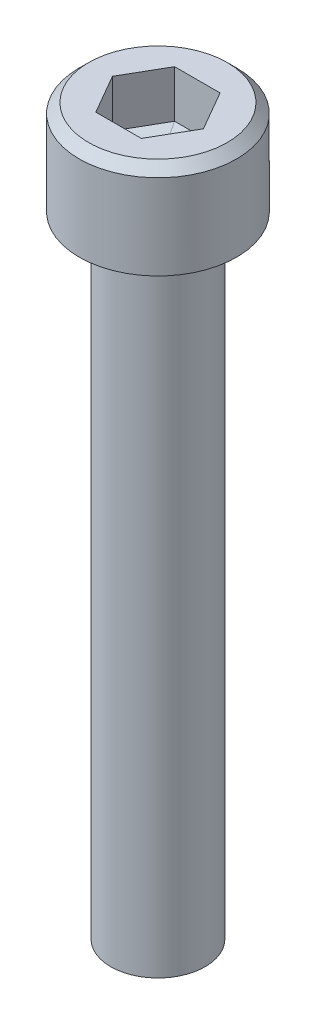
ISO-10303-21;
HEADER;
FILE_DESCRIPTION(('STEP AP214'),'2;1');
FILE_NAME('part.step','',(''),(''),'','','');
FILE_SCHEMA(('AUTOMOTIVE_DESIGN { 1 0 10303 214 1 1 1 1 }'));
ENDSEC;
DATA;
#1=APPLICATION_CONTEXT('core data for automotive mechanical design processes');
#2=APPLICATION_PROTOCOL_DEFINITION('international standard','automotive_design',2000,#1);
#3=PRODUCT_CONTEXT('',#1,'mechanical');
#4=PRODUCT('Part','Part','',(#3));
#5=PRODUCT_RELATED_PRODUCT_CATEGORY('part','',(#4));
#6=PRODUCT_DEFINITION_FORMATION('','',#4);
#7=PRODUCT_DEFINITION_CONTEXT('part definition',#1,'design');
#8=PRODUCT_DEFINITION('design','',#6,#7);
#9=PRODUCT_DEFINITION_SHAPE('','',#8);
#10=(LENGTH_UNIT() NAMED_UNIT(*) SI_UNIT(.MILLI.,.METRE.));
#11=(NAMED_UNIT(*) PLANE_ANGLE_UNIT() SI_UNIT($,.RADIAN.));
#12=(NAMED_UNIT(*) SI_UNIT($,.STERADIAN.) SOLID_ANGLE_UNIT());
#13=UNCERTAINTY_MEASURE_WITH_UNIT(LENGTH_MEASURE(1.E-05),#10,'distance_accuracy_value','');
#14=(GEOMETRIC_REPRESENTATION_CONTEXT(3) GLOBAL_UNCERTAINTY_ASSIGNED_CONTEXT((#13)) GLOBAL_UNIT_ASSIGNED_CONTEXT((#10,
#11,#12)) REPRESENTATION_CONTEXT('',''));
#15=CARTESIAN_POINT('',(0.,0.,0.));
#16=DIRECTION('',(0.,0.,1.));
#17=DIRECTION('',(1.,0.,0.));
#18=AXIS2_PLACEMENT_3D('',#15,#16,#17);
#19=CARTESIAN_POINT('',(-1.082531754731,-3.29999999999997,0.625000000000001));
#20=DIRECTION('',(-0.202106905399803,-0.972387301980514,0.116686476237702));
#21=DIRECTION('',(0.979075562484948,-0.203497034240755,0.));
#22=AXIS2_PLACEMENT_3D('',#19,#20,#21);
#23=PLANE('',#22);
#24=DIRECTION('',(0.500000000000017,0.,0.866025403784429));
#25=VECTOR('',#24,1.);
#26=CARTESIAN_POINT('',(-2.886751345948,-3.00000000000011,0.));
#27=LINE('',#26,#25);
#28=CARTESIAN_POINT('',(-2.88675134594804,-3.0000000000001,0.));
#29=VERTEX_POINT('',#28);
#30=CARTESIAN_POINT('',(-1.44337567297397,-3.00000000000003,2.49999999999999));
#31=VERTEX_POINT('',#30);
#32=EDGE_CURVE('E106',#29,#31,#27,.T.);
#33=ORIENTED_EDGE('',*,*,#32,.T.);
#34=DIRECTION('',(0.489537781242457,-0.203497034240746,-0.847904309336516));
#35=VECTOR('',#34,1.);
#36=CARTESIAN_POINT('',(-1.44337567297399,-2.99999999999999,2.5));
#37=LINE('',#36,#35);
#38=CARTESIAN_POINT('',(0.,-3.60000000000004,0.));
#39=VERTEX_POINT('',#38);
#40=EDGE_CURVE('E105',#31,#39,#37,.T.);
#41=ORIENTED_EDGE('',*,*,#40,.T.);
#42=DIRECTION('',(0.979075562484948,-0.203497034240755,0.));
#43=VECTOR('',#42,1.);
#44=CARTESIAN_POINT('',(-1.09747467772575,-3.37189417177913,0.));
#45=LINE('',#44,#43);
#46=EDGE_CURVE('E70',#39,#29,#45,.F.);
#47=ORIENTED_EDGE('',*,*,#46,.T.);
#48=EDGE_LOOP('',(#33,#41,#47));
#49=FACE_BOUND('',#48,.T.);
#50=ADVANCED_FACE('F16',(#49),#23,.F.);
#51=CARTESIAN_POINT('',(-1.082531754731,-3.29999999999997,-0.625000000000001));
#52=DIRECTION('',(-0.202106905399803,-0.972387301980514,-0.116686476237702));
#53=DIRECTION('',(0.979075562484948,-0.203497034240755,0.));
#54=AXIS2_PLACEMENT_3D('',#51,#52,#53);
#55=PLANE('',#54);
#56=DIRECTION('',(-0.500000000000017,0.,0.866025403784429));
#57=VECTOR('',#56,1.);
#58=CARTESIAN_POINT('',(-1.443375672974,-3.,-2.5));
#59=LINE('',#58,#57);
#60=CARTESIAN_POINT('',(-1.443375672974,-3.,-2.5));
#61=VERTEX_POINT('',#60);
#62=EDGE_CURVE('E78',#61,#29,#59,.T.);
#63=ORIENTED_EDGE('',*,*,#62,.T.);
#64=ORIENTED_EDGE('',*,*,#46,.F.);
#65=DIRECTION('',(-0.489537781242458,0.203497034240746,-0.847904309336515));
#66=VECTOR('',#65,1.);
#67=CARTESIAN_POINT('',(0.,-3.59999999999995,0.));
#68=LINE('',#67,#66);
#69=EDGE_CURVE('E75',#39,#61,#68,.T.);
#70=ORIENTED_EDGE('',*,*,#69,.T.);
#71=EDGE_LOOP('',(#63,#64,#70));
#72=FACE_BOUND('',#71,.T.);
#73=ADVANCED_FACE('F74',(#72),#55,.F.);
#74=CARTESIAN_POINT('',(0.,-3.29999999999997,-1.25));
#75=DIRECTION('',(0.,-0.972387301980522,-0.233372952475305));
#76=DIRECTION('',(0.,0.233372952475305,-0.972387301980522));
#77=AXIS2_PLACEMENT_3D('',#74,#75,#76);
#78=PLANE('',#77);
#79=DIRECTION('',(1.,0.,0.));
#80=VECTOR('',#79,1.);
#81=CARTESIAN_POINT('',(1.443375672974,-3.,-2.5));
#82=LINE('',#81,#80);
#83=CARTESIAN_POINT('',(1.44337567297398,-3.00000000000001,-2.49999999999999));
#84=VERTEX_POINT('',#83);
#85=EDGE_CURVE('E87',#84,#61,#82,.F.);
#86=ORIENTED_EDGE('',*,*,#85,.T.);
#87=ORIENTED_EDGE('',*,*,#69,.F.);
#88=DIRECTION('',(0.489537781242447,0.203497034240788,-0.847904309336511));
#89=VECTOR('',#88,1.);
#90=CARTESIAN_POINT('',(0.,-3.60000000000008,0.));
#91=LINE('',#90,#89);
#92=EDGE_CURVE('E84',#39,#84,#91,.T.);
#93=ORIENTED_EDGE('',*,*,#92,.T.);
#94=EDGE_LOOP('',(#86,#87,#93));
#95=FACE_BOUND('',#94,.T.);
#96=ADVANCED_FACE('F83',(#95),#78,.F.);
#97=CARTESIAN_POINT('',(1.082531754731,-3.29999999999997,-0.625000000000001));
#98=DIRECTION('',(0.202106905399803,-0.972387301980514,-0.116686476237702));
#99=DIRECTION('',(0.979075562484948,0.203497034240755,0.));
#100=AXIS2_PLACEMENT_3D('',#97,#98,#99);
#101=PLANE('',#100);
#102=DIRECTION('',(-0.500000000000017,0.,-0.866025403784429));
#103=VECTOR('',#102,1.);
#104=CARTESIAN_POINT('',(2.886751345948,-3.00000000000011,0.));
#105=LINE('',#104,#103);
#106=CARTESIAN_POINT('',(2.88675134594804,-3.0000000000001,0.));
#107=VERTEX_POINT('',#106);
#108=EDGE_CURVE('E95',#107,#84,#105,.T.);
#109=ORIENTED_EDGE('',*,*,#108,.T.);
#110=ORIENTED_EDGE('',*,*,#92,.F.);
#111=DIRECTION('',(0.979075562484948,0.203497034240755,0.));
#112=VECTOR('',#111,1.);
#113=CARTESIAN_POINT('',(1.09747467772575,-3.37189417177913,0.));
#114=LINE('',#113,#112);
#115=EDGE_CURVE('E92',#39,#107,#114,.T.);
#116=ORIENTED_EDGE('',*,*,#115,.T.);
#117=EDGE_LOOP('',(#109,#110,#116));
#118=FACE_BOUND('',#117,.T.);
#119=ADVANCED_FACE('F91',(#118),#101,.F.);
#120=CARTESIAN_POINT('',(1.082531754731,-3.29999999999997,0.625000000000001));
#121=DIRECTION('',(0.202106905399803,-0.972387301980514,0.116686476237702));
#122=DIRECTION('',(0.979075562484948,0.203497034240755,0.));
#123=AXIS2_PLACEMENT_3D('',#120,#121,#122);
#124=PLANE('',#123);
#125=DIRECTION('',(0.500000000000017,0.,-0.866025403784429));
#126=VECTOR('',#125,1.);
#127=CARTESIAN_POINT('',(1.443375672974,-3.,2.5));
#128=LINE('',#127,#126);
#129=CARTESIAN_POINT('',(1.443375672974,-3.,2.5));
#130=VERTEX_POINT('',#129);
#131=EDGE_CURVE('E102',#130,#107,#128,.T.);
#132=ORIENTED_EDGE('',*,*,#131,.T.);
#133=ORIENTED_EDGE('',*,*,#115,.F.);
#134=DIRECTION('',(0.489537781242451,0.203497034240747,0.847904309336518));
#135=VECTOR('',#134,1.);
#136=CARTESIAN_POINT('',(0.,-3.59999999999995,0.));
#137=LINE('',#136,#135);
#138=EDGE_CURVE('E100',#39,#130,#137,.T.);
#139=ORIENTED_EDGE('',*,*,#138,.T.);
#140=EDGE_LOOP('',(#132,#133,#139));
#141=FACE_BOUND('',#140,.T.);
#142=ADVANCED_FACE('F98',(#141),#124,.F.);
#143=CARTESIAN_POINT('',(0.,-3.29999999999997,1.25));
#144=DIRECTION('',(0.,-0.972387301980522,0.233372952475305));
#145=DIRECTION('',(0.,-0.233372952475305,-0.972387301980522));
#146=AXIS2_PLACEMENT_3D('',#143,#144,#145);
#147=PLANE('',#146);
#148=DIRECTION('',(1.,0.,0.));
#149=VECTOR('',#148,1.);
#150=CARTESIAN_POINT('',(-1.443375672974,-3.,2.5));
#151=LINE('',#150,#149);
#152=EDGE_CURVE('E112',#31,#130,#151,.T.);
#153=ORIENTED_EDGE('',*,*,#152,.T.);
#154=ORIENTED_EDGE('',*,*,#138,.F.);
#155=ORIENTED_EDGE('',*,*,#40,.F.);
#156=EDGE_LOOP('',(#153,#154,#155));
#157=FACE_BOUND('',#156,.T.);
#158=ADVANCED_FACE('F111',(#157),#147,.F.);
#159=CARTESIAN_POINT('',(-2.886751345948,0.,0.));
#160=DIRECTION('',(-0.866025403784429,0.,0.500000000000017));
#161=DIRECTION('',(0.500000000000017,0.,0.866025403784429));
#162=AXIS2_PLACEMENT_3D('',#159,#160,#161);
#163=PLANE('',#162);
#164=DIRECTION('',(0.,-1.,0.));
#165=VECTOR('',#164,1.);
#166=CARTESIAN_POINT('',(-1.44337567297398,0.,2.5));
#167=LINE('',#166,#165);
#168=CARTESIAN_POINT('',(-1.44337567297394,0.,2.49999999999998));
#169=VERTEX_POINT('',#168);
#170=EDGE_CURVE('E148',#169,#31,#167,.T.);
#171=ORIENTED_EDGE('',*,*,#170,.T.);
#172=ORIENTED_EDGE('',*,*,#32,.F.);
#173=DIRECTION('',(0.,1.,0.));
#174=VECTOR('',#173,1.);
#175=CARTESIAN_POINT('',(-2.88675134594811,0.,0.));
#176=LINE('',#175,#174);
#177=CARTESIAN_POINT('',(-2.88675134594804,0.,0.));
#178=VERTEX_POINT('',#177);
#179=EDGE_CURVE('E159',#29,#178,#176,.T.);
#180=ORIENTED_EDGE('',*,*,#179,.T.);
#181=DIRECTION('',(-0.499999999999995,0.,-0.866025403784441));
#182=VECTOR('',#181,1.);
#183=CARTESIAN_POINT('',(-1.44337567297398,0.,2.49999999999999));
#184=LINE('',#183,#182);
#185=EDGE_CURVE('E143',#169,#178,#184,.T.);
#186=ORIENTED_EDGE('',*,*,#185,.F.);
#187=EDGE_LOOP('',(#171,#172,#180,#186));
#188=FACE_BOUND('',#187,.T.);
#189=ADVANCED_FACE('F164',(#188),#163,.F.);
#190=CARTESIAN_POINT('',(-1.443375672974,0.,-2.5));
#191=DIRECTION('',(-0.866025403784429,0.,-0.500000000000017));
#192=DIRECTION('',(-0.500000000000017,0.,0.866025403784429));
#193=AXIS2_PLACEMENT_3D('',#190,#191,#192);
#194=PLANE('',#193);
#195=ORIENTED_EDGE('',*,*,#179,.F.);
#196=ORIENTED_EDGE('',*,*,#62,.F.);
#197=DIRECTION('',(0.,1.,0.));
#198=VECTOR('',#197,1.);
#199=CARTESIAN_POINT('',(-1.443375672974,0.,-2.5));
#200=LINE('',#199,#198);
#201=CARTESIAN_POINT('',(-1.443375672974,0.,-2.5));
#202=VERTEX_POINT('',#201);
#203=EDGE_CURVE('E156',#61,#202,#200,.T.);
#204=ORIENTED_EDGE('',*,*,#203,.T.);
#205=DIRECTION('',(0.499999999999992,0.,-0.866025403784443));
#206=VECTOR('',#205,1.);
#207=CARTESIAN_POINT('',(-2.88675134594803,0.,0.));
#208=LINE('',#207,#206);
#209=EDGE_CURVE('E140',#178,#202,#208,.T.);
#210=ORIENTED_EDGE('',*,*,#209,.F.);
#211=EDGE_LOOP('',(#195,#196,#204,#210));
#212=FACE_BOUND('',#211,.T.);
#213=ADVANCED_FACE('F167',(#212),#194,.F.);
#214=CARTESIAN_POINT('',(1.443375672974,0.,-2.5));
#215=DIRECTION('',(0.,0.,-1.));
#216=DIRECTION('',(0.,1.,0.));
#217=AXIS2_PLACEMENT_3D('',#214,#215,#216);
#218=PLANE('',#217);
#219=ORIENTED_EDGE('',*,*,#203,.F.);
#220=ORIENTED_EDGE('',*,*,#85,.F.);
#221=DIRECTION('',(0.,1.,0.));
#222=VECTOR('',#221,1.);
#223=CARTESIAN_POINT('',(1.4433756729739,0.,-2.49999999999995));
#224=LINE('',#223,#222);
#225=CARTESIAN_POINT('',(1.44337567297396,0.,-2.49999999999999));
#226=VERTEX_POINT('',#225);
#227=EDGE_CURVE('E153',#84,#226,#224,.T.);
#228=ORIENTED_EDGE('',*,*,#227,.T.);
#229=DIRECTION('',(1.,0.,0.));
#230=VECTOR('',#229,1.);
#231=CARTESIAN_POINT('',(0.,0.,-2.5));
#232=LINE('',#231,#230);
#233=EDGE_CURVE('E137',#202,#226,#232,.T.);
#234=ORIENTED_EDGE('',*,*,#233,.F.);
#235=EDGE_LOOP('',(#219,#220,#228,#234));
#236=FACE_BOUND('',#235,.T.);
#237=ADVANCED_FACE('F266',(#236),#218,.F.);
#238=CARTESIAN_POINT('',(2.886751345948,0.,0.));
#239=DIRECTION('',(0.866025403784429,0.,-0.500000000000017));
#240=DIRECTION('',(-0.500000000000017,0.,-0.866025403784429));
#241=AXIS2_PLACEMENT_3D('',#238,#239,#240);
#242=PLANE('',#241);
#243=ORIENTED_EDGE('',*,*,#227,.F.);
#244=ORIENTED_EDGE('',*,*,#108,.F.);
#245=DIRECTION('',(0.,1.,0.));
#246=VECTOR('',#245,1.);
#247=CARTESIAN_POINT('',(2.88675134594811,0.,0.));
#248=LINE('',#247,#246);
#249=CARTESIAN_POINT('',(2.88675134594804,0.,0.));
#250=VERTEX_POINT('',#249);
#251=EDGE_CURVE('E150',#107,#250,#248,.T.);
#252=ORIENTED_EDGE('',*,*,#251,.T.);
#253=DIRECTION('',(0.499999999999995,0.,0.866025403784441));
#254=VECTOR('',#253,1.);
#255=CARTESIAN_POINT('',(1.44337567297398,0.,-2.49999999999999));
#256=LINE('',#255,#254);
#257=EDGE_CURVE('E134',#226,#250,#256,.T.);
#258=ORIENTED_EDGE('',*,*,#257,.F.);
#259=EDGE_LOOP('',(#243,#244,#252,#258));
#260=FACE_BOUND('',#259,.T.);
#261=ADVANCED_FACE('F185',(#260),#242,.F.);
#262=CARTESIAN_POINT('',(1.443375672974,0.,2.5));
#263=DIRECTION('',(0.866025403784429,0.,0.500000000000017));
#264=DIRECTION('',(0.500000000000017,0.,-0.866025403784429));
#265=AXIS2_PLACEMENT_3D('',#262,#263,#264);
#266=PLANE('',#265);
#267=ORIENTED_EDGE('',*,*,#251,.F.);
#268=ORIENTED_EDGE('',*,*,#131,.F.);
#269=DIRECTION('',(0.,-1.,0.));
#270=VECTOR('',#269,1.);
#271=CARTESIAN_POINT('',(1.443375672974,0.,2.5));
#272=LINE('',#271,#270);
#273=CARTESIAN_POINT('',(1.443375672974,0.,2.5));
#274=VERTEX_POINT('',#273);
#275=EDGE_CURVE('E34',#130,#274,#272,.F.);
#276=ORIENTED_EDGE('',*,*,#275,.T.);
#277=DIRECTION('',(-0.499999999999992,0.,0.866025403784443));
#278=VECTOR('',#277,1.);
#279=CARTESIAN_POINT('',(2.88675134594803,0.,0.));
#280=LINE('',#279,#278);
#281=EDGE_CURVE('E131',#250,#274,#280,.T.);
#282=ORIENTED_EDGE('',*,*,#281,.F.);
#283=EDGE_LOOP('',(#267,#268,#276,#282));
#284=FACE_BOUND('',#283,.T.);
#285=ADVANCED_FACE('F175',(#284),#266,.F.);
#286=CARTESIAN_POINT('',(-1.443375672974,0.,2.5));
#287=DIRECTION('',(0.,0.,1.));
#288=DIRECTION('',(0.,-1.,0.));
#289=AXIS2_PLACEMENT_3D('',#286,#287,#288);
#290=PLANE('',#289);
#291=ORIENTED_EDGE('',*,*,#275,.F.);
#292=ORIENTED_EDGE('',*,*,#152,.F.);
#293=ORIENTED_EDGE('',*,*,#170,.F.);
#294=DIRECTION('',(1.,0.,0.));
#295=VECTOR('',#294,1.);
#296=CARTESIAN_POINT('',(0.,0.,2.5));
#297=LINE('',#296,#295);
#298=EDGE_CURVE('E127',#274,#169,#297,.F.);
#299=ORIENTED_EDGE('',*,*,#298,.F.);
#300=EDGE_LOOP('',(#291,#292,#293,#299));
#301=FACE_BOUND('',#300,.T.);
#302=ADVANCED_FACE('F173',(#301),#290,.F.);
#303=CARTESIAN_POINT('',(0.,0.,0.));
#304=DIRECTION('',(0.,1.,0.));
#305=DIRECTION('',(0.,0.,1.));
#306=AXIS2_PLACEMENT_3D('',#303,#304,#305);
#307=PLANE('',#306);
#308=CARTESIAN_POINT('',(0.,0.,0.));
#309=DIRECTION('',(0.,-1.,0.));
#310=DIRECTION('',(0.,0.,-1.));
#311=AXIS2_PLACEMENT_3D('',#308,#309,#310);
#312=CIRCLE('',#311,4.39999999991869);
#313=CARTESIAN_POINT('',(0.,0.,-4.39999999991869));
#314=VERTEX_POINT('',#313);
#315=EDGE_CURVE('E19',#314,#314,#312,.T.);
#316=ORIENTED_EDGE('',*,*,#315,.F.);
#317=EDGE_LOOP('',(#316));
#318=FACE_BOUND('',#317,.T.);
#319=ORIENTED_EDGE('',*,*,#281,.T.);
#320=ORIENTED_EDGE('',*,*,#298,.T.);
#321=ORIENTED_EDGE('',*,*,#185,.T.);
#322=ORIENTED_EDGE('',*,*,#209,.T.);
#323=ORIENTED_EDGE('',*,*,#233,.T.);
#324=ORIENTED_EDGE('',*,*,#257,.T.);
#325=EDGE_LOOP('',(#319,#320,#321,#322,#323,#324));
#326=FACE_BOUND('',#325,.T.);
#327=ADVANCED_FACE('F171',(#318,#326),#307,.T.);
#328=CARTESIAN_POINT('',(0.,-0.600000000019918,0.));
#329=DIRECTION('',(0.,-1.,0.));
#330=DIRECTION('',(0.,0.,-1.));
#331=AXIS2_PLACEMENT_3D('',#328,#329,#330);
#332=CONICAL_SURFACE('',#331,4.99999999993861,0.785398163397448);
#333=CARTESIAN_POINT('',(0.,-0.600000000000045,0.));
#334=DIRECTION('',(0.,1.,0.));
#335=DIRECTION('',(0.,0.,1.));
#336=AXIS2_PLACEMENT_3D('',#333,#334,#335);
#337=CIRCLE('',#336,5.);
#338=CARTESIAN_POINT('',(0.,-0.600000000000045,5.));
#339=VERTEX_POINT('',#338);
#340=EDGE_CURVE('E119',#339,#339,#337,.F.);
#341=ORIENTED_EDGE('',*,*,#340,.F.);
#342=EDGE_LOOP('',(#341));
#343=FACE_BOUND('',#342,.T.);
#344=ORIENTED_EDGE('',*,*,#315,.T.);
#345=EDGE_LOOP('',(#344));
#346=FACE_BOUND('',#345,.T.);
#347=ADVANCED_FACE('F182',(#343,#346),#332,.T.);
#348=CARTESIAN_POINT('',(0.,-48.3,0.));
#349=DIRECTION('',(0.,1.,0.));
#350=DIRECTION('',(0.,0.,1.));
#351=AXIS2_PLACEMENT_3D('',#348,#349,#350);
#352=CYLINDRICAL_SURFACE('',#351,5.);
#353=ORIENTED_EDGE('',*,*,#340,.T.);
#354=EDGE_LOOP('',(#353));
#355=FACE_BOUND('',#354,.T.);
#356=CARTESIAN_POINT('',(0.,-6.00000000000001,0.));
#357=DIRECTION('',(0.,1.,0.));
#358=DIRECTION('',(0.,0.,1.));
#359=AXIS2_PLACEMENT_3D('',#356,#357,#358);
#360=CIRCLE('',#359,5.);
#361=CARTESIAN_POINT('',(0.,-6.00000000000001,5.));
#362=VERTEX_POINT('',#361);
#363=EDGE_CURVE('E117',#362,#362,#360,.T.);
#364=ORIENTED_EDGE('',*,*,#363,.T.);
#365=EDGE_LOOP('',(#364));
#366=FACE_BOUND('',#365,.T.);
#367=ADVANCED_FACE('F202',(#355,#366),#352,.T.);
#368=CARTESIAN_POINT('',(0.,-46.,0.));
#369=DIRECTION('',(0.,1.,0.));
#370=DIRECTION('',(0.,0.,1.));
#371=AXIS2_PLACEMENT_3D('',#368,#369,#370);
#372=PLANE('',#371);
#373=CARTESIAN_POINT('',(0.,-46.,0.));
#374=DIRECTION('',(0.,1.,0.));
#375=DIRECTION('',(0.,0.,1.));
#376=AXIS2_PLACEMENT_3D('',#373,#374,#375);
#377=CIRCLE('',#376,3.);
#378=CARTESIAN_POINT('',(0.,-46.,3.));
#379=VERTEX_POINT('',#378);
#380=EDGE_CURVE('E25',#379,#379,#377,.T.);
#381=ORIENTED_EDGE('',*,*,#380,.F.);
#382=EDGE_LOOP('',(#381));
#383=FACE_BOUND('',#382,.T.);
#384=ADVANCED_FACE('F195',(#383),#372,.F.);
#385=CARTESIAN_POINT('',(0.,-6.00000000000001,0.));
#386=DIRECTION('',(0.,1.,0.));
#387=DIRECTION('',(0.,0.,1.));
#388=AXIS2_PLACEMENT_3D('',#385,#386,#387);
#389=PLANE('',#388);
#390=ORIENTED_EDGE('',*,*,#363,.F.);
#391=EDGE_LOOP('',(#390));
#392=FACE_BOUND('',#391,.T.);
#393=CARTESIAN_POINT('',(0.,-6.00000000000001,0.));
#394=DIRECTION('',(0.,1.,0.));
#395=DIRECTION('',(0.,0.,1.));
#396=AXIS2_PLACEMENT_3D('',#393,#394,#395);
#397=CIRCLE('',#396,3.);
#398=CARTESIAN_POINT('',(0.,-6.00000000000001,3.));
#399=VERTEX_POINT('',#398);
#400=EDGE_CURVE('E11',#399,#399,#397,.F.);
#401=ORIENTED_EDGE('',*,*,#400,.F.);
#402=EDGE_LOOP('',(#401));
#403=FACE_BOUND('',#402,.T.);
#404=ADVANCED_FACE('F189',(#392,#403),#389,.F.);
#405=CARTESIAN_POINT('',(0.,-48.3,0.));
#406=DIRECTION('',(0.,1.,0.));
#407=DIRECTION('',(0.,0.,1.));
#408=AXIS2_PLACEMENT_3D('',#405,#406,#407);
#409=CYLINDRICAL_SURFACE('',#408,3.);
#410=ORIENTED_EDGE('',*,*,#400,.T.);
#411=EDGE_LOOP('',(#410));
#412=FACE_BOUND('',#411,.T.);
#413=ORIENTED_EDGE('',*,*,#380,.T.);
#414=EDGE_LOOP('',(#413));
#415=FACE_BOUND('',#414,.T.);
#416=ADVANCED_FACE('F187',(#412,#415),#409,.T.);
#417=CLOSED_SHELL('',(#50,#73,#96,#119,#142,#158,#189,#213,#237,#261,#285,#302,#327,#347,#367,
#384,#404,#416));
#418=MANIFOLD_SOLID_BREP('B1',#417);
#419=ADVANCED_BREP_SHAPE_REPRESENTATION('',(#18,#418),#14);
#420=SHAPE_DEFINITION_REPRESENTATION(#9,#419);
ENDSEC;
END-ISO-10303-21;
